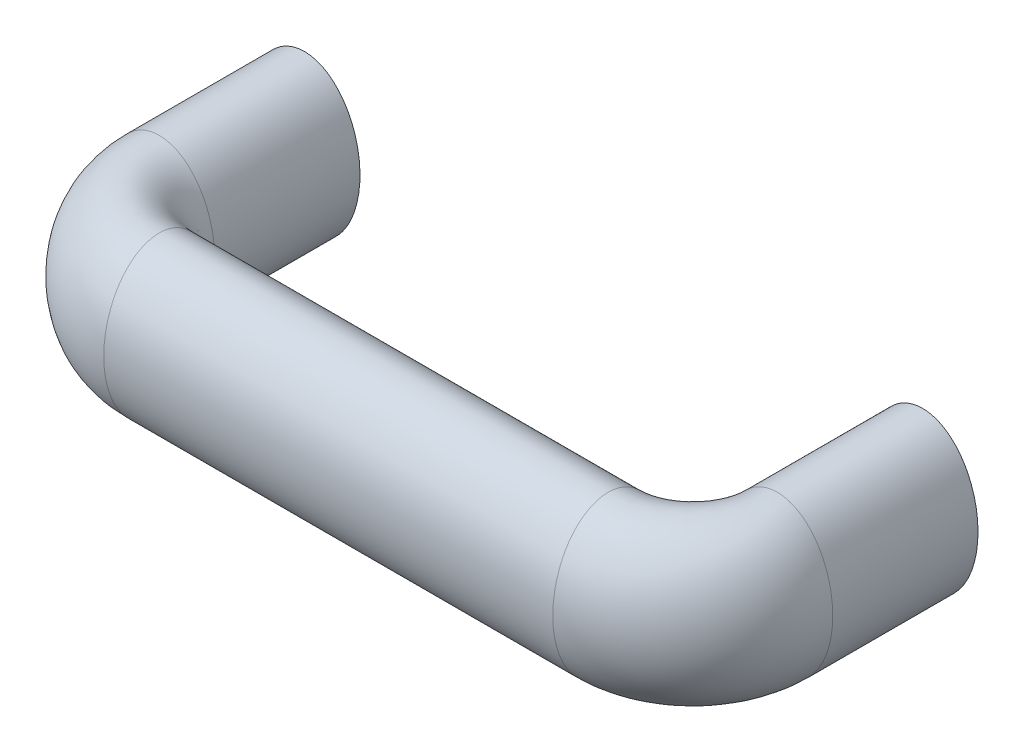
ISO-10303-21;
HEADER;
FILE_DESCRIPTION(('STEP AP214'),'2;1');
FILE_NAME('part.step','',(''),(''),'','','');
FILE_SCHEMA(('AUTOMOTIVE_DESIGN { 1 0 10303 214 1 1 1 1 }'));
ENDSEC;
DATA;
#1=APPLICATION_CONTEXT('core data for automotive mechanical design processes');
#2=APPLICATION_PROTOCOL_DEFINITION('international standard','automotive_design',2000,#1);
#3=PRODUCT_CONTEXT('',#1,'mechanical');
#4=PRODUCT('Part','Part','',(#3));
#5=PRODUCT_RELATED_PRODUCT_CATEGORY('part','',(#4));
#6=PRODUCT_DEFINITION_FORMATION('','',#4);
#7=PRODUCT_DEFINITION_CONTEXT('part definition',#1,'design');
#8=PRODUCT_DEFINITION('design','',#6,#7);
#9=PRODUCT_DEFINITION_SHAPE('','',#8);
#10=(LENGTH_UNIT() NAMED_UNIT(*) SI_UNIT(.MILLI.,.METRE.));
#11=(NAMED_UNIT(*) PLANE_ANGLE_UNIT() SI_UNIT($,.RADIAN.));
#12=(NAMED_UNIT(*) SI_UNIT($,.STERADIAN.) SOLID_ANGLE_UNIT());
#13=UNCERTAINTY_MEASURE_WITH_UNIT(LENGTH_MEASURE(1.E-05),#10,'distance_accuracy_value','');
#14=(GEOMETRIC_REPRESENTATION_CONTEXT(3) GLOBAL_UNCERTAINTY_ASSIGNED_CONTEXT((#13)) GLOBAL_UNIT_ASSIGNED_CONTEXT((#10,
#11,#12)) REPRESENTATION_CONTEXT('',''));
#15=CARTESIAN_POINT('',(0.,0.,0.));
#16=DIRECTION('',(0.,0.,1.));
#17=DIRECTION('',(1.,0.,0.));
#18=AXIS2_PLACEMENT_3D('',#15,#16,#17);
#19=CARTESIAN_POINT('',(117.,0.,27.5));
#20=DIRECTION('',(0.,0.,-1.));
#21=DIRECTION('',(0.,-1.,0.));
#22=AXIS2_PLACEMENT_3D('',#19,#20,#21);
#23=ELLIPSE('',#22,15.,10.5);
#24=DIRECTION('',(0.,0.,-1.));
#25=VECTOR('',#24,1.);
#26=SURFACE_OF_LINEAR_EXTRUSION('',#23,#25);
#27=CARTESIAN_POINT('',(117.,-15.,27.5));
#28=VERTEX_POINT('',#27);
#29=EDGE_CURVE('E18',#28,#28,#23,.T.);
#30=ORIENTED_EDGE('',*,*,#29,.T.);
#31=EDGE_LOOP('',(#30));
#32=FACE_BOUND('',#31,.T.);
#33=CARTESIAN_POINT('',(117.,0.,0.));
#34=DIRECTION('',(0.,0.,-1.));
#35=DIRECTION('',(0.,-1.,0.));
#36=AXIS2_PLACEMENT_3D('',#33,#34,#35);
#37=ELLIPSE('',#36,15.,10.5);
#38=CARTESIAN_POINT('',(117.,-15.,0.));
#39=VERTEX_POINT('',#38);
#40=EDGE_CURVE('E8',#39,#39,#37,.T.);
#41=ORIENTED_EDGE('',*,*,#40,.F.);
#42=EDGE_LOOP('',(#41));
#43=FACE_BOUND('',#42,.T.);
#44=ADVANCED_FACE('F12',(#32,#43),#26,.T.);
#45=CARTESIAN_POINT('',(101.,0.,43.5));
#46=DIRECTION('',(1.,0.,0.));
#47=DIRECTION('',(0.,-1.,0.));
#48=AXIS2_PLACEMENT_3D('',#45,#46,#47);
#49=ELLIPSE('',#48,15.,10.5);
#50=CARTESIAN_POINT('',(101.,0.,27.5));
#51=DIRECTION('',(0.,1.,0.));
#52=AXIS1_PLACEMENT('',#50,#51);
#53=SURFACE_OF_REVOLUTION('',#49,#52);
#54=CARTESIAN_POINT('',(101.,-15.,43.5));
#55=VERTEX_POINT('',#54);
#56=EDGE_CURVE('E22',#55,#55,#49,.T.);
#57=ORIENTED_EDGE('',*,*,#56,.T.);
#58=EDGE_LOOP('',(#57));
#59=FACE_BOUND('',#58,.T.);
#60=ORIENTED_EDGE('',*,*,#29,.F.);
#61=EDGE_LOOP('',(#60));
#62=FACE_BOUND('',#61,.T.);
#63=ADVANCED_FACE('F33',(#59,#62),#53,.F.);
#64=CARTESIAN_POINT('',(16.,0.,43.5));
#65=DIRECTION('',(1.,0.,0.));
#66=DIRECTION('',(0.,-1.,0.));
#67=AXIS2_PLACEMENT_3D('',#64,#65,#66);
#68=ELLIPSE('',#67,15.,10.5);
#69=DIRECTION('',(1.,0.,0.));
#70=VECTOR('',#69,1.);
#71=SURFACE_OF_LINEAR_EXTRUSION('',#68,#70);
#72=CARTESIAN_POINT('',(16.,-15.,43.5));
#73=VERTEX_POINT('',#72);
#74=EDGE_CURVE('E26',#73,#73,#68,.T.);
#75=ORIENTED_EDGE('',*,*,#74,.T.);
#76=EDGE_LOOP('',(#75));
#77=FACE_BOUND('',#76,.T.);
#78=ORIENTED_EDGE('',*,*,#56,.F.);
#79=EDGE_LOOP('',(#78));
#80=FACE_BOUND('',#79,.T.);
#81=ADVANCED_FACE('F36',(#77,#80),#71,.T.);
#82=CARTESIAN_POINT('',(0.,0.,27.5));
#83=DIRECTION('',(0.,0.,1.));
#84=DIRECTION('',(0.,-1.,0.));
#85=AXIS2_PLACEMENT_3D('',#82,#83,#84);
#86=ELLIPSE('',#85,15.,10.5);
#87=CARTESIAN_POINT('',(16.,0.,27.5));
#88=DIRECTION('',(0.,1.,0.));
#89=AXIS1_PLACEMENT('',#87,#88);
#90=SURFACE_OF_REVOLUTION('',#86,#89);
#91=CARTESIAN_POINT('',(0.,-15.,27.5));
#92=VERTEX_POINT('',#91);
#93=EDGE_CURVE('E48',#92,#92,#86,.T.);
#94=ORIENTED_EDGE('',*,*,#93,.T.);
#95=EDGE_LOOP('',(#94));
#96=FACE_BOUND('',#95,.T.);
#97=ORIENTED_EDGE('',*,*,#74,.F.);
#98=EDGE_LOOP('',(#97));
#99=FACE_BOUND('',#98,.T.);
#100=ADVANCED_FACE('F40',(#96,#99),#90,.F.);
#101=DIRECTION('',(0.,0.,-1.));
#102=VECTOR('',#101,1.);
#103=SURFACE_OF_LINEAR_EXTRUSION('',#86,#102);
#104=ORIENTED_EDGE('',*,*,#93,.F.);
#105=EDGE_LOOP('',(#104));
#106=FACE_BOUND('',#105,.T.);
#107=CARTESIAN_POINT('',(0.,0.,0.));
#108=DIRECTION('',(0.,0.,1.));
#109=DIRECTION('',(0.,-1.,0.));
#110=AXIS2_PLACEMENT_3D('',#107,#108,#109);
#111=ELLIPSE('',#110,15.,10.5);
#112=CARTESIAN_POINT('',(0.,-15.,0.));
#113=VERTEX_POINT('',#112);
#114=EDGE_CURVE('E52',#113,#113,#111,.T.);
#115=ORIENTED_EDGE('',*,*,#114,.T.);
#116=EDGE_LOOP('',(#115));
#117=FACE_BOUND('',#116,.T.);
#118=ADVANCED_FACE('F45',(#106,#117),#103,.F.);
#119=CARTESIAN_POINT('',(117.,0.,0.));
#120=DIRECTION('',(0.,0.,-1.));
#121=DIRECTION('',(-1.,0.,0.));
#122=AXIS2_PLACEMENT_3D('',#119,#120,#121);
#123=PLANE('',#122);
#124=CARTESIAN_POINT('',(117.,0.,0.));
#125=DIRECTION('',(0.,0.,-1.));
#126=DIRECTION('',(-1.,0.,0.));
#127=AXIS2_PLACEMENT_3D('',#124,#125,#126);
#128=CIRCLE('',#127,4.);
#129=CARTESIAN_POINT('',(113.,0.,0.));
#130=VERTEX_POINT('',#129);
#131=EDGE_CURVE('E66',#130,#130,#128,.T.);
#132=ORIENTED_EDGE('',*,*,#131,.F.);
#133=EDGE_LOOP('',(#132));
#134=FACE_BOUND('',#133,.T.);
#135=ORIENTED_EDGE('',*,*,#40,.T.);
#136=EDGE_LOOP('',(#135));
#137=FACE_BOUND('',#136,.T.);
#138=ADVANCED_FACE('F81',(#134,#137),#123,.T.);
#139=CARTESIAN_POINT('',(0.,0.,0.));
#140=DIRECTION('',(0.,0.,1.));
#141=DIRECTION('',(1.,0.,0.));
#142=AXIS2_PLACEMENT_3D('',#139,#140,#141);
#143=PLANE('',#142);
#144=CARTESIAN_POINT('',(0.,0.,0.));
#145=DIRECTION('',(0.,0.,-1.));
#146=DIRECTION('',(-1.,0.,0.));
#147=AXIS2_PLACEMENT_3D('',#144,#145,#146);
#148=CIRCLE('',#147,4.);
#149=CARTESIAN_POINT('',(-4.,0.,0.));
#150=VERTEX_POINT('',#149);
#151=EDGE_CURVE('E53',#150,#150,#148,.T.);
#152=ORIENTED_EDGE('',*,*,#151,.F.);
#153=EDGE_LOOP('',(#152));
#154=FACE_BOUND('',#153,.T.);
#155=ORIENTED_EDGE('',*,*,#114,.F.);
#156=EDGE_LOOP('',(#155));
#157=FACE_BOUND('',#156,.T.);
#158=ADVANCED_FACE('F83',(#154,#157),#143,.F.);
#159=CARTESIAN_POINT('',(0.,0.,13.));
#160=DIRECTION('',(0.,0.,-1.));
#161=DIRECTION('',(-1.,0.,0.));
#162=AXIS2_PLACEMENT_3D('',#159,#160,#161);
#163=CYLINDRICAL_SURFACE('',#162,4.);
#164=CARTESIAN_POINT('',(0.,0.,13.));
#165=DIRECTION('',(0.,0.,-1.));
#166=DIRECTION('',(-1.,0.,0.));
#167=AXIS2_PLACEMENT_3D('',#164,#165,#166);
#168=CIRCLE('',#167,4.);
#169=CARTESIAN_POINT('',(-4.,0.,13.));
#170=VERTEX_POINT('',#169);
#171=EDGE_CURVE('E57',#170,#170,#168,.T.);
#172=ORIENTED_EDGE('',*,*,#171,.F.);
#173=EDGE_LOOP('',(#172));
#174=FACE_BOUND('',#173,.T.);
#175=ORIENTED_EDGE('',*,*,#151,.T.);
#176=EDGE_LOOP('',(#175));
#177=FACE_BOUND('',#176,.T.);
#178=ADVANCED_FACE('F90',(#174,#177),#163,.F.);
#179=CARTESIAN_POINT('',(0.,0.,13.));
#180=DIRECTION('',(0.,0.,-1.));
#181=DIRECTION('',(-1.,0.,0.));
#182=AXIS2_PLACEMENT_3D('',#179,#180,#181);
#183=PLANE('',#182);
#184=ORIENTED_EDGE('',*,*,#171,.T.);
#185=EDGE_LOOP('',(#184));
#186=FACE_BOUND('',#185,.T.);
#187=ADVANCED_FACE('F77',(#186),#183,.T.);
#188=CARTESIAN_POINT('',(117.,0.,13.));
#189=DIRECTION('',(0.,0.,-1.));
#190=DIRECTION('',(-1.,0.,0.));
#191=AXIS2_PLACEMENT_3D('',#188,#189,#190);
#192=CYLINDRICAL_SURFACE('',#191,4.);
#193=CARTESIAN_POINT('',(117.,0.,13.));
#194=DIRECTION('',(0.,0.,-1.));
#195=DIRECTION('',(-1.,0.,0.));
#196=AXIS2_PLACEMENT_3D('',#193,#194,#195);
#197=CIRCLE('',#196,4.);
#198=CARTESIAN_POINT('',(113.,0.,13.));
#199=VERTEX_POINT('',#198);
#200=EDGE_CURVE('E64',#199,#199,#197,.T.);
#201=ORIENTED_EDGE('',*,*,#200,.F.);
#202=EDGE_LOOP('',(#201));
#203=FACE_BOUND('',#202,.T.);
#204=ORIENTED_EDGE('',*,*,#131,.T.);
#205=EDGE_LOOP('',(#204));
#206=FACE_BOUND('',#205,.T.);
#207=ADVANCED_FACE('F74',(#203,#206),#192,.F.);
#208=CARTESIAN_POINT('',(117.,0.,13.));
#209=DIRECTION('',(0.,0.,-1.));
#210=DIRECTION('',(-1.,0.,0.));
#211=AXIS2_PLACEMENT_3D('',#208,#209,#210);
#212=PLANE('',#211);
#213=ORIENTED_EDGE('',*,*,#200,.T.);
#214=EDGE_LOOP('',(#213));
#215=FACE_BOUND('',#214,.T.);
#216=ADVANCED_FACE('F72',(#215),#212,.T.);
#217=CLOSED_SHELL('',(#44,#63,#81,#100,#118,#138,#158,#178,#187,#207,#216));
#218=MANIFOLD_SOLID_BREP('B1',#217);
#219=ADVANCED_BREP_SHAPE_REPRESENTATION('',(#18,#218),#14);
#220=SHAPE_DEFINITION_REPRESENTATION(#9,#219);
ENDSEC;
END-ISO-10303-21;
